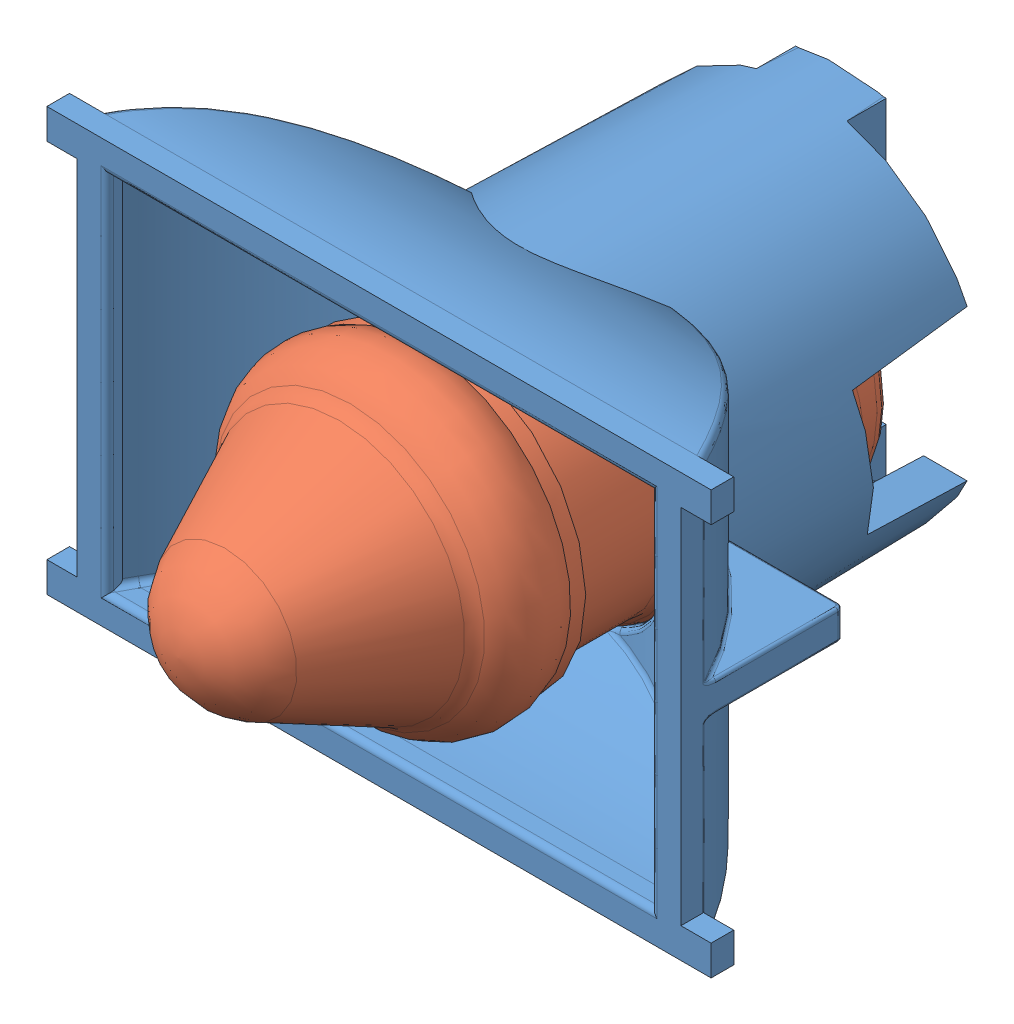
SolidWorks assembly Assemblage4.sldasm, configuration Défaut (file format 3100). Lengths in mm.
Overall size (22 15.29 22.1).
2 component instances, 2 part files, 2 mates.
Components (placement in the parent):
- Réflecteur-1: Réflecteur.SLDPRT [Défaut] at (-0.6249 1.3372 7.65) size (22 14.76 15.3)
- Ampoule-1: Ampoule.SLDPRT [Défaut] at (-0.6249 1.3372 5.3721) x (0 0 -1) z (0.746844 0.665 0) size (22.1 10.83 10.83)
Mates (geometry in assembly coordinates):
- Coaxiale1: concentric: cylinder of Réflecteur-1; cylinder of Ampoule-1
- Coïncidente1: coincident anti-aligned: plane of Réflecteur-1; plane of Ampoule-1
